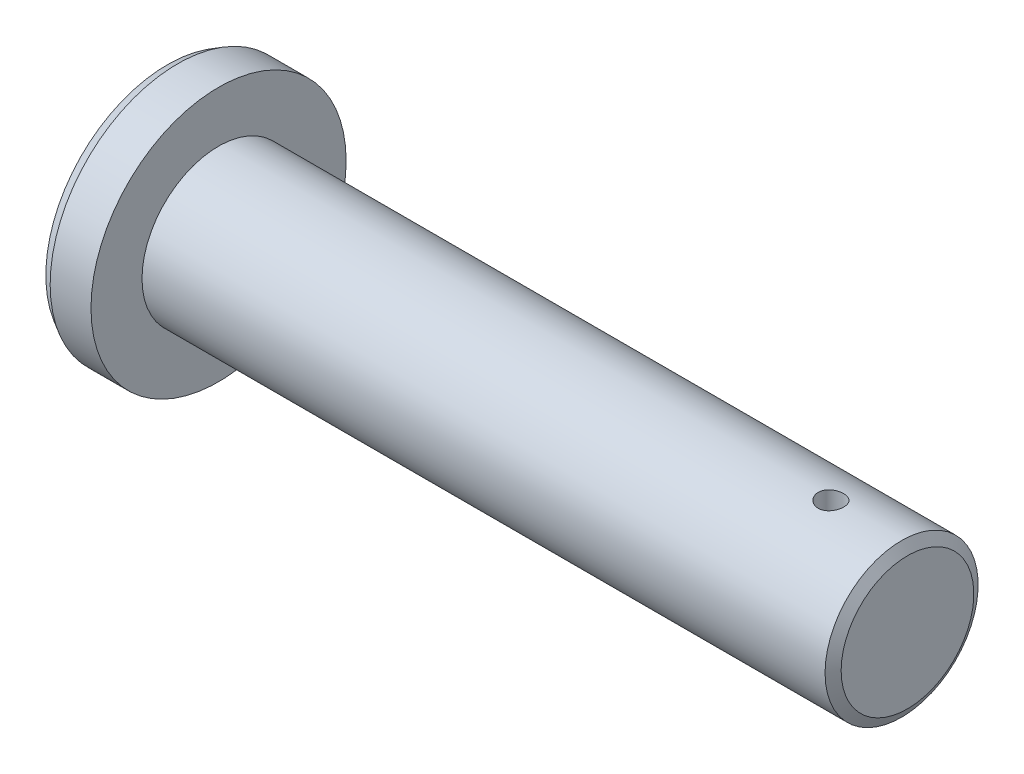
ISO-10303-21;
HEADER;
FILE_DESCRIPTION(('STEP AP214'),'2;1');
FILE_NAME('part.step','',(''),(''),'','','');
FILE_SCHEMA(('AUTOMOTIVE_DESIGN { 1 0 10303 214 1 1 1 1 }'));
ENDSEC;
DATA;
#1=APPLICATION_CONTEXT('core data for automotive mechanical design processes');
#2=APPLICATION_PROTOCOL_DEFINITION('international standard','automotive_design',2000,#1);
#3=PRODUCT_CONTEXT('',#1,'mechanical');
#4=PRODUCT('Part','Part','',(#3));
#5=PRODUCT_RELATED_PRODUCT_CATEGORY('part','',(#4));
#6=PRODUCT_DEFINITION_FORMATION('','',#4);
#7=PRODUCT_DEFINITION_CONTEXT('part definition',#1,'design');
#8=PRODUCT_DEFINITION('design','',#6,#7);
#9=PRODUCT_DEFINITION_SHAPE('','',#8);
#10=(LENGTH_UNIT() NAMED_UNIT(*) SI_UNIT(.MILLI.,.METRE.));
#11=(NAMED_UNIT(*) PLANE_ANGLE_UNIT() SI_UNIT($,.RADIAN.));
#12=(NAMED_UNIT(*) SI_UNIT($,.STERADIAN.) SOLID_ANGLE_UNIT());
#13=UNCERTAINTY_MEASURE_WITH_UNIT(LENGTH_MEASURE(1.E-05),#10,'distance_accuracy_value','');
#14=(GEOMETRIC_REPRESENTATION_CONTEXT(3) GLOBAL_UNCERTAINTY_ASSIGNED_CONTEXT((#13)) GLOBAL_UNIT_ASSIGNED_CONTEXT((#10,
#11,#12)) REPRESENTATION_CONTEXT('',''));
#15=CARTESIAN_POINT('',(0.,0.,0.));
#16=DIRECTION('',(0.,0.,1.));
#17=DIRECTION('',(1.,0.,0.));
#18=AXIS2_PLACEMENT_3D('',#15,#16,#17);
#19=CARTESIAN_POINT('',(0.,0.,0.));
#20=DIRECTION('',(1.,0.,0.));
#21=DIRECTION('',(0.,0.,-1.));
#22=AXIS2_PLACEMENT_3D('',#19,#20,#21);
#23=PLANE('',#22);
#24=CARTESIAN_POINT('',(0.,0.,0.));
#25=DIRECTION('',(1.,0.,0.));
#26=DIRECTION('',(0.,0.,-1.));
#27=AXIS2_PLACEMENT_3D('',#24,#25,#26);
#28=CIRCLE('',#27,23.8452994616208);
#29=CARTESIAN_POINT('',(0.,0.,-23.8452994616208));
#30=VERTEX_POINT('',#29);
#31=EDGE_CURVE('E87',#30,#30,#28,.F.);
#32=ORIENTED_EDGE('',*,*,#31,.T.);
#33=EDGE_LOOP('',(#32));
#34=FACE_BOUND('',#33,.T.);
#35=ADVANCED_FACE('F31',(#34),#23,.F.);
#36=CARTESIAN_POINT('',(-77.0453953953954,0.,0.));
#37=DIRECTION('',(-1.,0.,0.));
#38=DIRECTION('',(0.,0.,1.));
#39=AXIS2_PLACEMENT_3D('',#36,#37,#38);
#40=CYLINDRICAL_SURFACE('',#39,25.);
#41=CARTESIAN_POINT('',(2.,0.,0.));
#42=DIRECTION('',(1.,0.,0.));
#43=DIRECTION('',(0.,0.,-1.));
#44=AXIS2_PLACEMENT_3D('',#41,#42,#43);
#45=CIRCLE('',#44,25.);
#46=CARTESIAN_POINT('',(2.,0.,-25.));
#47=VERTEX_POINT('',#46);
#48=EDGE_CURVE('E47',#47,#47,#45,.T.);
#49=ORIENTED_EDGE('',*,*,#48,.T.);
#50=EDGE_LOOP('',(#49));
#51=FACE_BOUND('',#50,.T.);
#52=CARTESIAN_POINT('',(10.,0.,0.));
#53=DIRECTION('',(-1.,0.,0.));
#54=DIRECTION('',(0.,0.,1.));
#55=AXIS2_PLACEMENT_3D('',#52,#53,#54);
#56=CIRCLE('',#55,25.);
#57=CARTESIAN_POINT('',(10.,0.,25.));
#58=VERTEX_POINT('',#57);
#59=EDGE_CURVE('E89',#58,#58,#56,.T.);
#60=ORIENTED_EDGE('',*,*,#59,.T.);
#61=EDGE_LOOP('',(#60));
#62=FACE_BOUND('',#61,.T.);
#63=ADVANCED_FACE('F79',(#51,#62),#40,.T.);
#64=CARTESIAN_POINT('',(10.,25.,0.));
#65=DIRECTION('',(-1.,0.,0.));
#66=DIRECTION('',(0.,0.,1.));
#67=AXIS2_PLACEMENT_3D('',#64,#65,#66);
#68=PLANE('',#67);
#69=ORIENTED_EDGE('',*,*,#59,.F.);
#70=EDGE_LOOP('',(#69));
#71=FACE_BOUND('',#70,.T.);
#72=CARTESIAN_POINT('',(10.,0.,0.));
#73=DIRECTION('',(-1.,0.,0.));
#74=DIRECTION('',(0.,0.,1.));
#75=AXIS2_PLACEMENT_3D('',#72,#73,#74);
#76=CIRCLE('',#75,15.);
#77=CARTESIAN_POINT('',(10.,0.,15.));
#78=VERTEX_POINT('',#77);
#79=EDGE_CURVE('E93',#78,#78,#76,.T.);
#80=ORIENTED_EDGE('',*,*,#79,.T.);
#81=EDGE_LOOP('',(#80));
#82=FACE_BOUND('',#81,.T.);
#83=ADVANCED_FACE('F76',(#71,#82),#68,.F.);
#84=CARTESIAN_POINT('',(-77.0453953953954,0.,0.));
#85=DIRECTION('',(-1.,0.,0.));
#86=DIRECTION('',(0.,0.,1.));
#87=AXIS2_PLACEMENT_3D('',#84,#85,#86);
#88=CYLINDRICAL_SURFACE('',#87,15.);
#89=CARTESIAN_POINT('',(130.,-14.790199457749,2.5));
#90=CARTESIAN_POINT('',(130.139375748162,-14.790201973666,2.49999439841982));
#91=CARTESIAN_POINT('',(130.278827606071,-14.7921909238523,2.48830516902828));
#92=CARTESIAN_POINT('',(130.553818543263,-14.7999245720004,2.44187742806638));
#93=CARTESIAN_POINT('',(130.689353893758,-14.8056727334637,2.40711766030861));
#94=CARTESIAN_POINT('',(130.952492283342,-14.8202560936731,2.31562954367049));
#95=CARTESIAN_POINT('',(131.080101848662,-14.8290887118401,2.25891955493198));
#96=CARTESIAN_POINT('',(131.323980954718,-14.8488427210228,2.12518649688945));
#97=CARTESIAN_POINT('',(131.440251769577,-14.8597638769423,2.04816571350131));
#98=CARTESIAN_POINT('',(131.659312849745,-14.8825847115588,1.87518752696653));
#99=CARTESIAN_POINT('',(131.761975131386,-14.8944921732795,1.77906904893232));
#100=CARTESIAN_POINT('',(131.949793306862,-14.9178748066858,1.57097200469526));
#101=CARTESIAN_POINT('',(132.034948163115,-14.9293499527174,1.45899249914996));
#102=CARTESIAN_POINT('',(132.185814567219,-14.9506573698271,1.22152286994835));
#103=CARTESIAN_POINT('',(132.251407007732,-14.9604794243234,1.0959560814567));
#104=CARTESIAN_POINT('',(132.360521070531,-14.9772873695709,0.835395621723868));
#105=CARTESIAN_POINT('',(132.404044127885,-14.9842734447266,0.700402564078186));
#106=CARTESIAN_POINT('',(132.467392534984,-14.994567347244,0.426143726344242));
#107=CARTESIAN_POINT('',(132.487432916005,-14.9979085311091,0.286928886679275));
#108=CARTESIAN_POINT('',(132.503915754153,-15.0006507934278,0.00707528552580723));
#109=CARTESIAN_POINT('',(132.500359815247,-15.0000521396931,-0.133563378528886));
#110=CARTESIAN_POINT('',(132.469918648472,-14.9950085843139,-0.410802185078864));
#111=CARTESIAN_POINT('',(132.443264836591,-14.990601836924,-0.547428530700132));
#112=CARTESIAN_POINT('',(132.367748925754,-14.9784797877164,-0.814241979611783));
#113=CARTESIAN_POINT('',(132.318886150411,-14.9707643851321,-0.944428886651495));
#114=CARTESIAN_POINT('',(132.200109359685,-14.9528269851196,-1.19535614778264));
#115=CARTESIAN_POINT('',(132.130099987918,-14.9425936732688,-1.31605052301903));
#116=CARTESIAN_POINT('',(131.971087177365,-14.920757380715,-1.54406552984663));
#117=CARTESIAN_POINT('',(131.882082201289,-14.9091542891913,-1.65138507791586));
#118=CARTESIAN_POINT('',(131.686321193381,-14.885702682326,-1.85097127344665));
#119=CARTESIAN_POINT('',(131.579362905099,-14.8738528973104,-1.9430395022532));
#120=CARTESIAN_POINT('',(131.351412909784,-14.8513795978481,-2.10795458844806));
#121=CARTESIAN_POINT('',(131.230421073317,-14.8407560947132,-2.18080126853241));
#122=CARTESIAN_POINT('',(130.977608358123,-14.8219375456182,-2.30524443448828));
#123=CARTESIAN_POINT('',(130.845775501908,-14.813745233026,-2.35681702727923));
#124=CARTESIAN_POINT('',(130.575150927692,-14.8007618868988,-2.4370298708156));
#125=CARTESIAN_POINT('',(130.436359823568,-14.7959705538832,-2.46567214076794));
#126=CARTESIAN_POINT('',(130.157533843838,-14.7903895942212,-2.49893188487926));
#127=CARTESIAN_POINT('',(130.017533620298,-14.7895528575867,-2.50383220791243));
#128=CARTESIAN_POINT('',(129.738713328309,-14.7918503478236,-2.49022270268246));
#129=CARTESIAN_POINT('',(129.599893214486,-14.7949844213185,-2.47171377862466));
#130=CARTESIAN_POINT('',(129.328272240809,-14.8048268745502,-2.4120523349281));
#131=CARTESIAN_POINT('',(129.195438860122,-14.8115125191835,-2.37104379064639));
#132=CARTESIAN_POINT('',(128.938529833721,-14.827685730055,-2.26769819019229));
#133=CARTESIAN_POINT('',(128.814454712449,-14.8371734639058,-2.20535985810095));
#134=CARTESIAN_POINT('',(128.577325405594,-14.8579912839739,-2.06045667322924));
#135=CARTESIAN_POINT('',(128.464383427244,-14.8693375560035,-1.97771056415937));
#136=CARTESIAN_POINT('',(128.253886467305,-14.8925466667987,-1.79458946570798));
#137=CARTESIAN_POINT('',(128.15633256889,-14.9044095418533,-1.69421323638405));
#138=CARTESIAN_POINT('',(127.978348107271,-14.9274642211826,-1.47742807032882));
#139=CARTESIAN_POINT('',(127.898106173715,-14.9386477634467,-1.36086325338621));
#140=CARTESIAN_POINT('',(127.758344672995,-14.9589511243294,-1.11574344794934));
#141=CARTESIAN_POINT('',(127.698824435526,-14.9680710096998,-0.987188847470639));
#142=CARTESIAN_POINT('',(127.602489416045,-14.9831835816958,-0.722299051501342));
#143=CARTESIAN_POINT('',(127.565575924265,-14.9891898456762,-0.586000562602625));
#144=CARTESIAN_POINT('',(127.515184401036,-14.9974558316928,-0.309030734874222));
#145=CARTESIAN_POINT('',(127.501704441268,-14.9997158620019,-0.16835975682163));
#146=CARTESIAN_POINT('',(127.498618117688,-15.0002303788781,0.111541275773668));
#147=CARTESIAN_POINT('',(127.508724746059,-14.9985330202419,0.250768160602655));
#148=CARTESIAN_POINT('',(127.551903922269,-14.9914217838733,0.525511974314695));
#149=CARTESIAN_POINT('',(127.58497634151,-14.9860079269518,0.661028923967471));
#150=CARTESIAN_POINT('',(127.673038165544,-14.972069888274,0.924396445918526));
#151=CARTESIAN_POINT('',(127.72800316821,-14.9635491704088,1.0522553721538));
#152=CARTESIAN_POINT('',(127.858257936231,-14.9443275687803,1.29698045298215));
#153=CARTESIAN_POINT('',(127.933548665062,-14.9336265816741,1.41384608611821));
#154=CARTESIAN_POINT('',(128.10333509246,-14.9110762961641,1.63471294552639));
#155=CARTESIAN_POINT('',(128.198040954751,-14.8992152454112,1.73855143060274));
#156=CARTESIAN_POINT('',(128.403528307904,-14.8757630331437,1.9289638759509));
#157=CARTESIAN_POINT('',(128.514313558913,-14.8641719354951,2.01553378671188));
#158=CARTESIAN_POINT('',(128.74974532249,-14.8424834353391,2.16951427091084));
#159=CARTESIAN_POINT('',(128.874484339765,-14.8323971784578,2.23678498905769));
#160=CARTESIAN_POINT('',(129.133609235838,-14.8149921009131,2.34931453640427));
#161=CARTESIAN_POINT('',(129.267985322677,-14.8076705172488,2.39459535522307));
#162=CARTESIAN_POINT('',(129.502403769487,-14.7982474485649,2.45202605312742));
#163=CARTESIAN_POINT('',(129.601026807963,-14.7952462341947,2.46998741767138));
#164=CARTESIAN_POINT('',(129.799753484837,-14.7912213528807,2.49397629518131));
#165=CARTESIAN_POINT('',(129.899857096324,-14.7901976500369,2.50000402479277));
#166=CARTESIAN_POINT('',(130.,-14.790199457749,2.5));
#167=B_SPLINE_CURVE_WITH_KNOTS('',3,(#89,#90,#91,#92,#93,#94,#95,#96,#97,#98,#99,#100,#101,#102,
#103,#104,#105,#106,#107,#108,#109,#110,#111,#112,#113,#114,#115,#116,#117,#118,#119,#120,#121,
#122,#123,#124,#125,#126,#127,#128,#129,#130,#131,#132,#133,#134,#135,#136,#137,#138,#139,#140,
#141,#142,#143,#144,#145,#146,#147,#148,#149,#150,#151,#152,#153,#154,#155,#156,#157,#158,#159,
#160,#161,#162,#163,#164,#165,#166),.UNSPECIFIED.,.T.,.F.,(4,2,2,2,2,2,2,2,2,2,2,2,2,2,2,2,2,2,
2,2,2,2,2,2,2,2,2,2,2,2,2,2,2,2,2,2,2,2,4),(0.,0.417761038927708,0.835907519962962,
1.25370499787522,1.67145547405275,2.09289159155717,2.51435267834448,2.93832980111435,
3.36227935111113,3.78231567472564,4.2023234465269,4.61817121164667,5.03403164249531,
5.45179604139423,5.86959426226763,6.29246123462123,6.71533210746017,7.138676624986,
7.56198385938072,7.98023542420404,8.39847083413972,8.81406064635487,9.2296753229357,
9.649123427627,10.0686010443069,10.4924411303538,10.9162675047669,11.3382298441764,
11.7601574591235,12.1769777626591,12.5937957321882,13.0101503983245,13.4265248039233,
13.8476699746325,14.2689137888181,14.6931372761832,15.1169356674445,15.4171067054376,
15.7172722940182),.UNSPECIFIED.);
#168=CARTESIAN_POINT('',(130.,-14.790199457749,2.5));
#169=VERTEX_POINT('',#168);
#170=EDGE_CURVE('E34',#169,#169,#167,.T.);
#171=ORIENTED_EDGE('',*,*,#170,.T.);
#172=EDGE_LOOP('',(#171));
#173=FACE_BOUND('',#172,.T.);
#174=CARTESIAN_POINT('',(130.,14.790199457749,2.5));
#175=CARTESIAN_POINT('',(129.860624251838,14.790201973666,2.49999439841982));
#176=CARTESIAN_POINT('',(129.721172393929,14.7921909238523,2.48830516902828));
#177=CARTESIAN_POINT('',(129.446181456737,14.7999245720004,2.44187742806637));
#178=CARTESIAN_POINT('',(129.310646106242,14.8056727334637,2.4071176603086));
#179=CARTESIAN_POINT('',(129.047507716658,14.8202560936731,2.31562954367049));
#180=CARTESIAN_POINT('',(128.919898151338,14.8290887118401,2.25891955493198));
#181=CARTESIAN_POINT('',(128.676019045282,14.8488427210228,2.12518649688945));
#182=CARTESIAN_POINT('',(128.559748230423,14.8597638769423,2.04816571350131));
#183=CARTESIAN_POINT('',(128.340687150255,14.8825847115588,1.87518752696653));
#184=CARTESIAN_POINT('',(128.238024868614,14.8944921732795,1.77906904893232));
#185=CARTESIAN_POINT('',(128.050206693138,14.9178748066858,1.57097200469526));
#186=CARTESIAN_POINT('',(127.965051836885,14.9293499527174,1.45899249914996));
#187=CARTESIAN_POINT('',(127.814185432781,14.9506573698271,1.22152286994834));
#188=CARTESIAN_POINT('',(127.748592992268,14.9604794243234,1.09595608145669));
#189=CARTESIAN_POINT('',(127.639478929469,14.9772873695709,0.835395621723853));
#190=CARTESIAN_POINT('',(127.595955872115,14.9842734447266,0.700402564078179));
#191=CARTESIAN_POINT('',(127.532607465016,14.994567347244,0.426143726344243));
#192=CARTESIAN_POINT('',(127.512567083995,14.9979085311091,0.286928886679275));
#193=CARTESIAN_POINT('',(127.496084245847,15.0006507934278,0.00707528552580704));
#194=CARTESIAN_POINT('',(127.499640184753,15.0000521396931,-0.133563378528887));
#195=CARTESIAN_POINT('',(127.530081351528,14.9950085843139,-0.410802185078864));
#196=CARTESIAN_POINT('',(127.556735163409,14.990601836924,-0.547428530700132));
#197=CARTESIAN_POINT('',(127.632251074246,14.9784797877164,-0.814241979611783));
#198=CARTESIAN_POINT('',(127.681113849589,14.9707643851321,-0.944428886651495));
#199=CARTESIAN_POINT('',(127.799890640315,14.9528269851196,-1.19535614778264));
#200=CARTESIAN_POINT('',(127.869900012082,14.9425936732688,-1.31605052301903));
#201=CARTESIAN_POINT('',(128.028912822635,14.920757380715,-1.54406552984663));
#202=CARTESIAN_POINT('',(128.117917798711,14.9091542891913,-1.65138507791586));
#203=CARTESIAN_POINT('',(128.313678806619,14.885702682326,-1.85097127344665));
#204=CARTESIAN_POINT('',(128.420637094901,14.8738528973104,-1.9430395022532));
#205=CARTESIAN_POINT('',(128.648587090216,14.8513795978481,-2.10795458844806));
#206=CARTESIAN_POINT('',(128.769578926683,14.8407560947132,-2.18080126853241));
#207=CARTESIAN_POINT('',(129.022391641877,14.8219375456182,-2.30524443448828));
#208=CARTESIAN_POINT('',(129.154224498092,14.813745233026,-2.35681702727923));
#209=CARTESIAN_POINT('',(129.424849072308,14.8007618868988,-2.4370298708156));
#210=CARTESIAN_POINT('',(129.563640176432,14.7959705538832,-2.46567214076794));
#211=CARTESIAN_POINT('',(129.842466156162,14.7903895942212,-2.49893188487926));
#212=CARTESIAN_POINT('',(129.982466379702,14.7895528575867,-2.50383220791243));
#213=CARTESIAN_POINT('',(130.261286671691,14.7918503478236,-2.49022270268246));
#214=CARTESIAN_POINT('',(130.400106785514,14.7949844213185,-2.47171377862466));
#215=CARTESIAN_POINT('',(130.671727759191,14.8048268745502,-2.4120523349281));
#216=CARTESIAN_POINT('',(130.804561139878,14.8115125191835,-2.37104379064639));
#217=CARTESIAN_POINT('',(131.061470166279,14.827685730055,-2.26769819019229));
#218=CARTESIAN_POINT('',(131.185545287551,14.8371734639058,-2.20535985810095));
#219=CARTESIAN_POINT('',(131.422674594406,14.8579912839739,-2.06045667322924));
#220=CARTESIAN_POINT('',(131.535616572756,14.8693375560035,-1.97771056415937));
#221=CARTESIAN_POINT('',(131.746113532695,14.8925466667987,-1.79458946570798));
#222=CARTESIAN_POINT('',(131.84366743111,14.9044095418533,-1.69421323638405));
#223=CARTESIAN_POINT('',(132.021651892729,14.9274642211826,-1.47742807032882));
#224=CARTESIAN_POINT('',(132.101893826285,14.9386477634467,-1.36086325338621));
#225=CARTESIAN_POINT('',(132.241655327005,14.9589511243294,-1.11574344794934));
#226=CARTESIAN_POINT('',(132.301175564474,14.9680710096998,-0.987188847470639));
#227=CARTESIAN_POINT('',(132.397510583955,14.9831835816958,-0.722299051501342));
#228=CARTESIAN_POINT('',(132.434424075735,14.9891898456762,-0.586000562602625));
#229=CARTESIAN_POINT('',(132.484815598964,14.9974558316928,-0.309030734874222));
#230=CARTESIAN_POINT('',(132.498295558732,14.9997158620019,-0.16835975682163));
#231=CARTESIAN_POINT('',(132.501381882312,15.0002303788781,0.111541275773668));
#232=CARTESIAN_POINT('',(132.491275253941,14.9985330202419,0.250768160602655));
#233=CARTESIAN_POINT('',(132.448096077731,14.9914217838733,0.525511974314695));
#234=CARTESIAN_POINT('',(132.41502365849,14.9860079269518,0.661028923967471));
#235=CARTESIAN_POINT('',(132.326961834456,14.972069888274,0.924396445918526));
#236=CARTESIAN_POINT('',(132.27199683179,14.9635491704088,1.0522553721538));
#237=CARTESIAN_POINT('',(132.141742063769,14.9443275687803,1.29698045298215));
#238=CARTESIAN_POINT('',(132.066451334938,14.9336265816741,1.41384608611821));
#239=CARTESIAN_POINT('',(131.89666490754,14.9110762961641,1.63471294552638));
#240=CARTESIAN_POINT('',(131.801959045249,14.8992152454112,1.73855143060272));
#241=CARTESIAN_POINT('',(131.596471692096,14.8757630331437,1.92896387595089));
#242=CARTESIAN_POINT('',(131.485686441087,14.8641719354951,2.01553378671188));
#243=CARTESIAN_POINT('',(131.25025467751,14.8424834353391,2.16951427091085));
#244=CARTESIAN_POINT('',(131.125515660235,14.8323971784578,2.23678498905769));
#245=CARTESIAN_POINT('',(130.866390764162,14.8149921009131,2.34931453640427));
#246=CARTESIAN_POINT('',(130.732014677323,14.8076705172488,2.39459535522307));
#247=CARTESIAN_POINT('',(130.497596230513,14.7982474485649,2.45202605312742));
#248=CARTESIAN_POINT('',(130.398973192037,14.7952462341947,2.46998741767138));
#249=CARTESIAN_POINT('',(130.200246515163,14.7912213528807,2.49397629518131));
#250=CARTESIAN_POINT('',(130.100142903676,14.7901976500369,2.50000402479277));
#251=CARTESIAN_POINT('',(130.,14.790199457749,2.5));
#252=B_SPLINE_CURVE_WITH_KNOTS('',3,(#174,#175,#176,#177,#178,#179,#180,#181,#182,#183,#184,
#185,#186,#187,#188,#189,#190,#191,#192,#193,#194,#195,#196,#197,#198,#199,#200,#201,#202,#203,
#204,#205,#206,#207,#208,#209,#210,#211,#212,#213,#214,#215,#216,#217,#218,#219,#220,#221,#222,
#223,#224,#225,#226,#227,#228,#229,#230,#231,#232,#233,#234,#235,#236,#237,#238,#239,#240,#241,
#242,#243,#244,#245,#246,#247,#248,#249,#250,#251),.UNSPECIFIED.,.T.,.F.,(4,2,2,2,2,2,2,2,2,2,2,
2,2,2,2,2,2,2,2,2,2,2,2,2,2,2,2,2,2,2,2,2,2,2,2,2,2,2,4),(0.,0.417761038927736,
0.835907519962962,1.25370499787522,1.67145547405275,2.09289159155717,2.51435267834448,
2.93832980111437,3.36227935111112,3.78231567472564,4.2023234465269,4.61817121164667,
5.03403164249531,5.45179604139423,5.86959426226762,6.29246123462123,6.71533210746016,
7.138676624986,7.56198385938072,7.98023542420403,8.39847083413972,8.81406064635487,
9.2296753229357,9.649123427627,10.0686010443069,10.4924411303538,10.9162675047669,
11.3382298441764,11.7601574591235,12.1769777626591,12.5937957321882,13.0101503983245,
13.4265248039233,13.8476699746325,14.2689137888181,14.6931372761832,15.1169356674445,
15.4171067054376,15.7172722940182),.UNSPECIFIED.);
#253=CARTESIAN_POINT('',(130.,14.790199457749,2.5));
#254=VERTEX_POINT('',#253);
#255=EDGE_CURVE('E50',#254,#254,#252,.T.);
#256=ORIENTED_EDGE('',*,*,#255,.T.);
#257=EDGE_LOOP('',(#256));
#258=FACE_BOUND('',#257,.T.);
#259=CARTESIAN_POINT('',(143.845299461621,0.,0.));
#260=DIRECTION('',(-1.,0.,0.));
#261=DIRECTION('',(0.,0.,1.));
#262=AXIS2_PLACEMENT_3D('',#259,#260,#261);
#263=CIRCLE('',#262,15.);
#264=CARTESIAN_POINT('',(143.845299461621,0.,15.));
#265=VERTEX_POINT('',#264);
#266=EDGE_CURVE('E42',#265,#265,#263,.T.);
#267=ORIENTED_EDGE('',*,*,#266,.T.);
#268=EDGE_LOOP('',(#267));
#269=FACE_BOUND('',#268,.T.);
#270=ORIENTED_EDGE('',*,*,#79,.F.);
#271=EDGE_LOOP('',(#270));
#272=FACE_BOUND('',#271,.T.);
#273=ADVANCED_FACE('F54',(#173,#258,#269,#272),#88,.T.);
#274=CARTESIAN_POINT('',(145.,15.,0.));
#275=DIRECTION('',(-1.,0.,0.));
#276=DIRECTION('',(0.,0.,1.));
#277=AXIS2_PLACEMENT_3D('',#274,#275,#276);
#278=PLANE('',#277);
#279=CARTESIAN_POINT('',(145.,0.,0.));
#280=DIRECTION('',(-1.,0.,0.));
#281=DIRECTION('',(0.,0.,1.));
#282=AXIS2_PLACEMENT_3D('',#279,#280,#281);
#283=CIRCLE('',#282,13.);
#284=CARTESIAN_POINT('',(145.,0.,13.));
#285=VERTEX_POINT('',#284);
#286=EDGE_CURVE('E10',#285,#285,#283,.F.);
#287=ORIENTED_EDGE('',*,*,#286,.T.);
#288=EDGE_LOOP('',(#287));
#289=FACE_BOUND('',#288,.T.);
#290=ADVANCED_FACE('F70',(#289),#278,.F.);
#291=CARTESIAN_POINT('',(0.,0.,0.));
#292=DIRECTION('',(1.,0.,0.));
#293=DIRECTION('',(0.,0.,-1.));
#294=AXIS2_PLACEMENT_3D('',#291,#292,#293);
#295=CONICAL_SURFACE('',#294,23.8452994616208,0.523598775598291);
#296=ORIENTED_EDGE('',*,*,#48,.F.);
#297=EDGE_LOOP('',(#296));
#298=FACE_BOUND('',#297,.T.);
#299=ORIENTED_EDGE('',*,*,#31,.F.);
#300=EDGE_LOOP('',(#299));
#301=FACE_BOUND('',#300,.T.);
#302=ADVANCED_FACE('F67',(#298,#301),#295,.T.);
#303=CARTESIAN_POINT('',(143.845299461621,0.,0.));
#304=DIRECTION('',(-1.,0.,0.));
#305=DIRECTION('',(0.,0.,1.));
#306=AXIS2_PLACEMENT_3D('',#303,#304,#305);
#307=CONICAL_SURFACE('',#306,15.,1.04719755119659);
#308=ORIENTED_EDGE('',*,*,#286,.F.);
#309=EDGE_LOOP('',(#308));
#310=FACE_BOUND('',#309,.T.);
#311=ORIENTED_EDGE('',*,*,#266,.F.);
#312=EDGE_LOOP('',(#311));
#313=FACE_BOUND('',#312,.T.);
#314=ADVANCED_FACE('F62',(#310,#313),#307,.T.);
#315=CARTESIAN_POINT('',(130.,-25.,0.));
#316=DIRECTION('',(0.,1.,0.));
#317=DIRECTION('',(0.,0.,1.));
#318=AXIS2_PLACEMENT_3D('',#315,#316,#317);
#319=CYLINDRICAL_SURFACE('',#318,2.5);
#320=ORIENTED_EDGE('',*,*,#255,.F.);
#321=EDGE_LOOP('',(#320));
#322=FACE_BOUND('',#321,.T.);
#323=ORIENTED_EDGE('',*,*,#170,.F.);
#324=EDGE_LOOP('',(#323));
#325=FACE_BOUND('',#324,.T.);
#326=ADVANCED_FACE('F58',(#322,#325),#319,.F.);
#327=CLOSED_SHELL('',(#35,#63,#83,#273,#290,#302,#314,#326));
#328=MANIFOLD_SOLID_BREP('B2',#327);
#329=ADVANCED_BREP_SHAPE_REPRESENTATION('',(#18,#328),#14);
#330=SHAPE_DEFINITION_REPRESENTATION(#9,#329);
ENDSEC;
END-ISO-10303-21;
